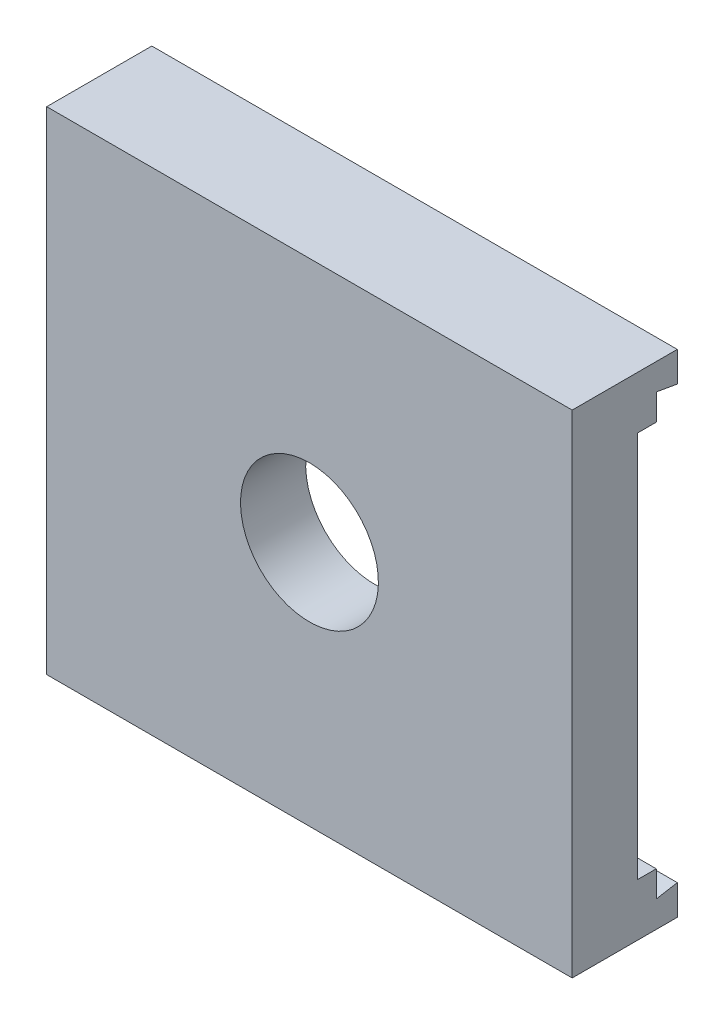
ISO-10303-21;
HEADER;
FILE_DESCRIPTION(('STEP AP214'),'2;1');
FILE_NAME('part.step','',(''),(''),'','','');
FILE_SCHEMA(('AUTOMOTIVE_DESIGN { 1 0 10303 214 1 1 1 1 }'));
ENDSEC;
DATA;
#1=APPLICATION_CONTEXT('core data for automotive mechanical design processes');
#2=APPLICATION_PROTOCOL_DEFINITION('international standard','automotive_design',2000,#1);
#3=PRODUCT_CONTEXT('',#1,'mechanical');
#4=PRODUCT('Part','Part','',(#3));
#5=PRODUCT_RELATED_PRODUCT_CATEGORY('part','',(#4));
#6=PRODUCT_DEFINITION_FORMATION('','',#4);
#7=PRODUCT_DEFINITION_CONTEXT('part definition',#1,'design');
#8=PRODUCT_DEFINITION('design','',#6,#7);
#9=PRODUCT_DEFINITION_SHAPE('','',#8);
#10=(LENGTH_UNIT() NAMED_UNIT(*) SI_UNIT(.MILLI.,.METRE.));
#11=(NAMED_UNIT(*) PLANE_ANGLE_UNIT() SI_UNIT($,.RADIAN.));
#12=(NAMED_UNIT(*) SI_UNIT($,.STERADIAN.) SOLID_ANGLE_UNIT());
#13=UNCERTAINTY_MEASURE_WITH_UNIT(LENGTH_MEASURE(1.E-05),#10,'distance_accuracy_value','');
#14=(GEOMETRIC_REPRESENTATION_CONTEXT(3) GLOBAL_UNCERTAINTY_ASSIGNED_CONTEXT((#13)) GLOBAL_UNIT_ASSIGNED_CONTEXT((#10,
#11,#12)) REPRESENTATION_CONTEXT('',''));
#15=CARTESIAN_POINT('',(0.,0.,0.));
#16=DIRECTION('',(0.,0.,1.));
#17=DIRECTION('',(1.,0.,0.));
#18=AXIS2_PLACEMENT_3D('',#15,#16,#17);
#19=CARTESIAN_POINT('',(-31.75,-29.718,7.874));
#20=DIRECTION('',(0.,1.,0.));
#21=DIRECTION('',(-1.,0.,0.));
#22=AXIS2_PLACEMENT_3D('',#19,#20,#21);
#23=PLANE('',#22);
#24=DIRECTION('',(0.,0.,1.));
#25=VECTOR('',#24,1.);
#26=CARTESIAN_POINT('',(31.75,-29.718,7.874));
#27=LINE('',#26,#25);
#28=CARTESIAN_POINT('',(31.75,-29.718,-4.826));
#29=VERTEX_POINT('',#28);
#30=CARTESIAN_POINT('',(31.75,-29.718,7.874));
#31=VERTEX_POINT('',#30);
#32=EDGE_CURVE('E107',#29,#31,#27,.T.);
#33=ORIENTED_EDGE('',*,*,#32,.T.);
#34=DIRECTION('',(1.,0.,0.));
#35=VECTOR('',#34,1.);
#36=CARTESIAN_POINT('',(-31.75,-29.718,7.874));
#37=LINE('',#36,#35);
#38=CARTESIAN_POINT('',(-31.75,-29.718,7.874));
#39=VERTEX_POINT('',#38);
#40=EDGE_CURVE('E9',#39,#31,#37,.T.);
#41=ORIENTED_EDGE('',*,*,#40,.F.);
#42=DIRECTION('',(0.,0.,1.));
#43=VECTOR('',#42,1.);
#44=CARTESIAN_POINT('',(-31.75,-29.718,7.874));
#45=LINE('',#44,#43);
#46=CARTESIAN_POINT('',(-31.75,-29.718,-4.826));
#47=VERTEX_POINT('',#46);
#48=EDGE_CURVE('E146',#47,#39,#45,.T.);
#49=ORIENTED_EDGE('',*,*,#48,.F.);
#50=DIRECTION('',(1.,0.,0.));
#51=VECTOR('',#50,1.);
#52=CARTESIAN_POINT('',(-31.75,-29.718,-4.826));
#53=LINE('',#52,#51);
#54=EDGE_CURVE('E120',#47,#29,#53,.T.);
#55=ORIENTED_EDGE('',*,*,#54,.T.);
#56=EDGE_LOOP('',(#33,#41,#49,#55));
#57=FACE_BOUND('',#56,.T.);
#58=ADVANCED_FACE('F14',(#57),#23,.F.);
#59=CARTESIAN_POINT('',(-31.75,29.718,7.874));
#60=DIRECTION('',(0.,0.,-1.));
#61=DIRECTION('',(0.,-1.,0.));
#62=AXIS2_PLACEMENT_3D('',#59,#60,#61);
#63=PLANE('',#62);
#64=CARTESIAN_POINT('',(0.,0.,7.874));
#65=DIRECTION('',(0.,0.,1.));
#66=DIRECTION('',(0.,1.,0.));
#67=AXIS2_PLACEMENT_3D('',#64,#65,#66);
#68=CIRCLE('',#67,8.3312);
#69=CARTESIAN_POINT('',(0.,8.3312,7.874));
#70=VERTEX_POINT('',#69);
#71=EDGE_CURVE('E123',#70,#70,#68,.T.);
#72=ORIENTED_EDGE('',*,*,#71,.F.);
#73=EDGE_LOOP('',(#72));
#74=FACE_BOUND('',#73,.T.);
#75=DIRECTION('',(0.,1.,0.));
#76=VECTOR('',#75,1.);
#77=CARTESIAN_POINT('',(31.75,29.718,7.874));
#78=LINE('',#77,#76);
#79=CARTESIAN_POINT('',(31.75,29.718,7.874));
#80=VERTEX_POINT('',#79);
#81=EDGE_CURVE('E103',#31,#80,#78,.T.);
#82=ORIENTED_EDGE('',*,*,#81,.T.);
#83=DIRECTION('',(1.,0.,0.));
#84=VECTOR('',#83,1.);
#85=CARTESIAN_POINT('',(-31.75,29.718,7.874));
#86=LINE('',#85,#84);
#87=CARTESIAN_POINT('',(-31.75,29.718,7.874));
#88=VERTEX_POINT('',#87);
#89=EDGE_CURVE('E22',#88,#80,#86,.T.);
#90=ORIENTED_EDGE('',*,*,#89,.F.);
#91=DIRECTION('',(0.,1.,0.));
#92=VECTOR('',#91,1.);
#93=CARTESIAN_POINT('',(-31.75,29.718,7.874));
#94=LINE('',#93,#92);
#95=EDGE_CURVE('E116',#39,#88,#94,.T.);
#96=ORIENTED_EDGE('',*,*,#95,.F.);
#97=ORIENTED_EDGE('',*,*,#40,.T.);
#98=EDGE_LOOP('',(#82,#90,#96,#97));
#99=FACE_BOUND('',#98,.T.);
#100=ADVANCED_FACE('F115',(#74,#99),#63,.F.);
#101=CARTESIAN_POINT('',(-31.75,29.718,7.874));
#102=DIRECTION('',(0.,-1.,0.));
#103=DIRECTION('',(1.,0.,0.));
#104=AXIS2_PLACEMENT_3D('',#101,#102,#103);
#105=PLANE('',#104);
#106=DIRECTION('',(0.,0.,-1.));
#107=VECTOR('',#106,1.);
#108=CARTESIAN_POINT('',(31.75,29.718,7.874));
#109=LINE('',#108,#107);
#110=CARTESIAN_POINT('',(31.75,29.718,-4.826));
#111=VERTEX_POINT('',#110);
#112=EDGE_CURVE('E109',#80,#111,#109,.T.);
#113=ORIENTED_EDGE('',*,*,#112,.T.);
#114=DIRECTION('',(1.,0.,0.));
#115=VECTOR('',#114,1.);
#116=CARTESIAN_POINT('',(-31.75,29.718,-4.826));
#117=LINE('',#116,#115);
#118=CARTESIAN_POINT('',(-31.75,29.718,-4.826));
#119=VERTEX_POINT('',#118);
#120=EDGE_CURVE('E192',#119,#111,#117,.T.);
#121=ORIENTED_EDGE('',*,*,#120,.F.);
#122=DIRECTION('',(0.,0.,-1.));
#123=VECTOR('',#122,1.);
#124=CARTESIAN_POINT('',(-31.75,29.718,7.874));
#125=LINE('',#124,#123);
#126=EDGE_CURVE('E149',#88,#119,#125,.T.);
#127=ORIENTED_EDGE('',*,*,#126,.F.);
#128=ORIENTED_EDGE('',*,*,#89,.T.);
#129=EDGE_LOOP('',(#113,#121,#127,#128));
#130=FACE_BOUND('',#129,.T.);
#131=ADVANCED_FACE('F197',(#130),#105,.F.);
#132=CARTESIAN_POINT('',(-31.75,29.718,-4.826));
#133=DIRECTION('',(0.,0.,1.));
#134=DIRECTION('',(0.,1.,0.));
#135=AXIS2_PLACEMENT_3D('',#132,#133,#134);
#136=PLANE('',#135);
#137=DIRECTION('',(0.,-1.,0.));
#138=VECTOR('',#137,1.);
#139=CARTESIAN_POINT('',(31.75,29.718,-4.826));
#140=LINE('',#139,#138);
#141=CARTESIAN_POINT('',(31.75,26.0858,-4.826));
#142=VERTEX_POINT('',#141);
#143=EDGE_CURVE('E127',#111,#142,#140,.T.);
#144=ORIENTED_EDGE('',*,*,#143,.T.);
#145=DIRECTION('',(1.,0.,0.));
#146=VECTOR('',#145,1.);
#147=CARTESIAN_POINT('',(-31.75,26.0858,-4.826));
#148=LINE('',#147,#146);
#149=CARTESIAN_POINT('',(-31.75,26.0858,-4.826));
#150=VERTEX_POINT('',#149);
#151=EDGE_CURVE('E189',#150,#142,#148,.T.);
#152=ORIENTED_EDGE('',*,*,#151,.F.);
#153=DIRECTION('',(0.,-1.,0.));
#154=VECTOR('',#153,1.);
#155=CARTESIAN_POINT('',(-31.75,29.718,-4.826));
#156=LINE('',#155,#154);
#157=EDGE_CURVE('E151',#119,#150,#156,.T.);
#158=ORIENTED_EDGE('',*,*,#157,.F.);
#159=ORIENTED_EDGE('',*,*,#120,.T.);
#160=EDGE_LOOP('',(#144,#152,#158,#159));
#161=FACE_BOUND('',#160,.T.);
#162=ADVANCED_FACE('F205',(#161),#136,.F.);
#163=CARTESIAN_POINT('',(-31.75,26.0858,-4.826));
#164=DIRECTION('',(0.,0.984807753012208,-0.173648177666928));
#165=DIRECTION('',(0.,-0.173648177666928,-0.984807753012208));
#166=AXIS2_PLACEMENT_3D('',#163,#164,#165);
#167=PLANE('',#166);
#168=DIRECTION('',(0.,0.173648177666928,0.984807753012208));
#169=VECTOR('',#168,1.);
#170=CARTESIAN_POINT('',(31.75,26.0858,-4.826));
#171=LINE('',#170,#169);
#172=CARTESIAN_POINT('',(31.75,26.5336705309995,-2.286));
#173=VERTEX_POINT('',#172);
#174=EDGE_CURVE('E129',#142,#173,#171,.T.);
#175=ORIENTED_EDGE('',*,*,#174,.T.);
#176=DIRECTION('',(1.,0.,0.));
#177=VECTOR('',#176,1.);
#178=CARTESIAN_POINT('',(-31.75,26.5336705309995,-2.286));
#179=LINE('',#178,#177);
#180=CARTESIAN_POINT('',(-31.75,26.5336705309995,-2.286));
#181=VERTEX_POINT('',#180);
#182=EDGE_CURVE('E186',#181,#173,#179,.T.);
#183=ORIENTED_EDGE('',*,*,#182,.F.);
#184=DIRECTION('',(0.,0.173648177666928,0.984807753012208));
#185=VECTOR('',#184,1.);
#186=CARTESIAN_POINT('',(-31.75,26.0858,-4.826));
#187=LINE('',#186,#185);
#188=EDGE_CURVE('E153',#150,#181,#187,.T.);
#189=ORIENTED_EDGE('',*,*,#188,.F.);
#190=ORIENTED_EDGE('',*,*,#151,.T.);
#191=EDGE_LOOP('',(#175,#183,#189,#190));
#192=FACE_BOUND('',#191,.T.);
#193=ADVANCED_FACE('F208',(#192),#167,.F.);
#194=CARTESIAN_POINT('',(-31.75,26.5336705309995,-2.286));
#195=DIRECTION('',(0.,0.,1.));
#196=DIRECTION('',(0.,1.,0.));
#197=AXIS2_PLACEMENT_3D('',#194,#195,#196);
#198=PLANE('',#197);
#199=DIRECTION('',(0.,-1.,0.));
#200=VECTOR('',#199,1.);
#201=CARTESIAN_POINT('',(31.75,26.5336705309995,-2.286));
#202=LINE('',#201,#200);
#203=CARTESIAN_POINT('',(31.75,23.368,-2.286));
#204=VERTEX_POINT('',#203);
#205=EDGE_CURVE('E131',#173,#204,#202,.T.);
#206=ORIENTED_EDGE('',*,*,#205,.T.);
#207=DIRECTION('',(1.,0.,0.));
#208=VECTOR('',#207,1.);
#209=CARTESIAN_POINT('',(-31.75,23.368,-2.286));
#210=LINE('',#209,#208);
#211=CARTESIAN_POINT('',(-31.75,23.368,-2.286));
#212=VERTEX_POINT('',#211);
#213=EDGE_CURVE('E183',#212,#204,#210,.T.);
#214=ORIENTED_EDGE('',*,*,#213,.F.);
#215=DIRECTION('',(0.,-1.,0.));
#216=VECTOR('',#215,1.);
#217=CARTESIAN_POINT('',(-31.75,26.5336705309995,-2.286));
#218=LINE('',#217,#216);
#219=EDGE_CURVE('E155',#181,#212,#218,.T.);
#220=ORIENTED_EDGE('',*,*,#219,.F.);
#221=ORIENTED_EDGE('',*,*,#182,.T.);
#222=EDGE_LOOP('',(#206,#214,#220,#221));
#223=FACE_BOUND('',#222,.T.);
#224=ADVANCED_FACE('F213',(#223),#198,.F.);
#225=CARTESIAN_POINT('',(-31.75,23.368,-2.286));
#226=DIRECTION('',(0.,1.,0.));
#227=DIRECTION('',(-1.,0.,0.));
#228=AXIS2_PLACEMENT_3D('',#225,#226,#227);
#229=PLANE('',#228);
#230=DIRECTION('',(0.,0.,1.));
#231=VECTOR('',#230,1.);
#232=CARTESIAN_POINT('',(31.75,23.368,-2.286));
#233=LINE('',#232,#231);
#234=CARTESIAN_POINT('',(31.75,23.368,0.));
#235=VERTEX_POINT('',#234);
#236=EDGE_CURVE('E133',#204,#235,#233,.T.);
#237=ORIENTED_EDGE('',*,*,#236,.T.);
#238=DIRECTION('',(1.,0.,0.));
#239=VECTOR('',#238,1.);
#240=CARTESIAN_POINT('',(-31.75,23.368,0.));
#241=LINE('',#240,#239);
#242=CARTESIAN_POINT('',(-31.75,23.368,0.));
#243=VERTEX_POINT('',#242);
#244=EDGE_CURVE('E180',#243,#235,#241,.T.);
#245=ORIENTED_EDGE('',*,*,#244,.F.);
#246=DIRECTION('',(0.,0.,1.));
#247=VECTOR('',#246,1.);
#248=CARTESIAN_POINT('',(-31.75,23.368,-2.286));
#249=LINE('',#248,#247);
#250=EDGE_CURVE('E157',#212,#243,#249,.T.);
#251=ORIENTED_EDGE('',*,*,#250,.F.);
#252=ORIENTED_EDGE('',*,*,#213,.T.);
#253=EDGE_LOOP('',(#237,#245,#251,#252));
#254=FACE_BOUND('',#253,.T.);
#255=ADVANCED_FACE('F219',(#254),#229,.F.);
#256=CARTESIAN_POINT('',(-31.75,-23.368,0.));
#257=DIRECTION('',(0.,0.,1.));
#258=DIRECTION('',(0.,1.,0.));
#259=AXIS2_PLACEMENT_3D('',#256,#257,#258);
#260=PLANE('',#259);
#261=CARTESIAN_POINT('',(0.,0.,0.));
#262=DIRECTION('',(0.,0.,1.));
#263=DIRECTION('',(0.,1.,0.));
#264=AXIS2_PLACEMENT_3D('',#261,#262,#263);
#265=CIRCLE('',#264,8.3312);
#266=CARTESIAN_POINT('',(0.,8.3312,0.));
#267=VERTEX_POINT('',#266);
#268=EDGE_CURVE('E17',#267,#267,#265,.T.);
#269=ORIENTED_EDGE('',*,*,#268,.T.);
#270=EDGE_LOOP('',(#269));
#271=FACE_BOUND('',#270,.T.);
#272=DIRECTION('',(0.,-1.,0.));
#273=VECTOR('',#272,1.);
#274=CARTESIAN_POINT('',(31.75,-23.368,0.));
#275=LINE('',#274,#273);
#276=CARTESIAN_POINT('',(31.75,-23.368,0.));
#277=VERTEX_POINT('',#276);
#278=EDGE_CURVE('E136',#235,#277,#275,.T.);
#279=ORIENTED_EDGE('',*,*,#278,.T.);
#280=DIRECTION('',(1.,0.,0.));
#281=VECTOR('',#280,1.);
#282=CARTESIAN_POINT('',(-31.75,-23.368,0.));
#283=LINE('',#282,#281);
#284=CARTESIAN_POINT('',(-31.75,-23.368,0.));
#285=VERTEX_POINT('',#284);
#286=EDGE_CURVE('E177',#285,#277,#283,.T.);
#287=ORIENTED_EDGE('',*,*,#286,.F.);
#288=DIRECTION('',(0.,-1.,0.));
#289=VECTOR('',#288,1.);
#290=CARTESIAN_POINT('',(-31.75,23.368,0.));
#291=LINE('',#290,#289);
#292=EDGE_CURVE('E159',#243,#285,#291,.T.);
#293=ORIENTED_EDGE('',*,*,#292,.F.);
#294=ORIENTED_EDGE('',*,*,#244,.T.);
#295=EDGE_LOOP('',(#279,#287,#293,#294));
#296=FACE_BOUND('',#295,.T.);
#297=ADVANCED_FACE('F222',(#271,#296),#260,.F.);
#298=CARTESIAN_POINT('',(-31.75,-23.368,-2.286));
#299=DIRECTION('',(0.,-1.,0.));
#300=DIRECTION('',(1.,0.,0.));
#301=AXIS2_PLACEMENT_3D('',#298,#299,#300);
#302=PLANE('',#301);
#303=DIRECTION('',(0.,0.,-1.));
#304=VECTOR('',#303,1.);
#305=CARTESIAN_POINT('',(31.75,-23.368,-2.286));
#306=LINE('',#305,#304);
#307=CARTESIAN_POINT('',(31.75,-23.368,-2.286));
#308=VERTEX_POINT('',#307);
#309=EDGE_CURVE('E138',#277,#308,#306,.T.);
#310=ORIENTED_EDGE('',*,*,#309,.T.);
#311=DIRECTION('',(1.,0.,0.));
#312=VECTOR('',#311,1.);
#313=CARTESIAN_POINT('',(-31.75,-23.368,-2.286));
#314=LINE('',#313,#312);
#315=CARTESIAN_POINT('',(-31.75,-23.368,-2.286));
#316=VERTEX_POINT('',#315);
#317=EDGE_CURVE('E174',#316,#308,#314,.T.);
#318=ORIENTED_EDGE('',*,*,#317,.F.);
#319=DIRECTION('',(0.,0.,-1.));
#320=VECTOR('',#319,1.);
#321=CARTESIAN_POINT('',(-31.75,-23.368,-2.286));
#322=LINE('',#321,#320);
#323=EDGE_CURVE('E161',#285,#316,#322,.T.);
#324=ORIENTED_EDGE('',*,*,#323,.F.);
#325=ORIENTED_EDGE('',*,*,#286,.T.);
#326=EDGE_LOOP('',(#310,#318,#324,#325));
#327=FACE_BOUND('',#326,.T.);
#328=ADVANCED_FACE('F227',(#327),#302,.F.);
#329=CARTESIAN_POINT('',(-31.75,-26.5336705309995,-2.286));
#330=DIRECTION('',(0.,0.,1.));
#331=DIRECTION('',(-1.,0.,0.));
#332=AXIS2_PLACEMENT_3D('',#329,#330,#331);
#333=PLANE('',#332);
#334=DIRECTION('',(0.,-1.,0.));
#335=VECTOR('',#334,1.);
#336=CARTESIAN_POINT('',(31.75,-26.5336705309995,-2.286));
#337=LINE('',#336,#335);
#338=CARTESIAN_POINT('',(31.75,-26.5336705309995,-2.286));
#339=VERTEX_POINT('',#338);
#340=EDGE_CURVE('E140',#308,#339,#337,.T.);
#341=ORIENTED_EDGE('',*,*,#340,.T.);
#342=DIRECTION('',(1.,0.,0.));
#343=VECTOR('',#342,1.);
#344=CARTESIAN_POINT('',(-31.75,-26.5336705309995,-2.286));
#345=LINE('',#344,#343);
#346=CARTESIAN_POINT('',(-31.75,-26.5336705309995,-2.286));
#347=VERTEX_POINT('',#346);
#348=EDGE_CURVE('E171',#347,#339,#345,.T.);
#349=ORIENTED_EDGE('',*,*,#348,.F.);
#350=DIRECTION('',(0.,-1.,0.));
#351=VECTOR('',#350,1.);
#352=CARTESIAN_POINT('',(-31.75,-26.5336705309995,-2.286));
#353=LINE('',#352,#351);
#354=EDGE_CURVE('E163',#316,#347,#353,.T.);
#355=ORIENTED_EDGE('',*,*,#354,.F.);
#356=ORIENTED_EDGE('',*,*,#317,.T.);
#357=EDGE_LOOP('',(#341,#349,#355,#356));
#358=FACE_BOUND('',#357,.T.);
#359=ADVANCED_FACE('F231',(#358),#333,.F.);
#360=CARTESIAN_POINT('',(-31.75,-26.0858,-4.826));
#361=DIRECTION('',(0.,-0.984807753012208,-0.173648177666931));
#362=DIRECTION('',(0.,-0.173648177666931,0.984807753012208));
#363=AXIS2_PLACEMENT_3D('',#360,#361,#362);
#364=PLANE('',#363);
#365=DIRECTION('',(0.,0.173648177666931,-0.984807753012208));
#366=VECTOR('',#365,1.);
#367=CARTESIAN_POINT('',(31.75,-26.0858,-4.826));
#368=LINE('',#367,#366);
#369=CARTESIAN_POINT('',(31.75,-26.0858,-4.826));
#370=VERTEX_POINT('',#369);
#371=EDGE_CURVE('E142',#339,#370,#368,.T.);
#372=ORIENTED_EDGE('',*,*,#371,.T.);
#373=DIRECTION('',(1.,0.,0.));
#374=VECTOR('',#373,1.);
#375=CARTESIAN_POINT('',(-31.75,-26.0858,-4.826));
#376=LINE('',#375,#374);
#377=CARTESIAN_POINT('',(-31.75,-26.0858,-4.826));
#378=VERTEX_POINT('',#377);
#379=EDGE_CURVE('E168',#378,#370,#376,.T.);
#380=ORIENTED_EDGE('',*,*,#379,.F.);
#381=DIRECTION('',(0.,0.173648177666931,-0.984807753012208));
#382=VECTOR('',#381,1.);
#383=CARTESIAN_POINT('',(-31.75,-26.0858,-4.826));
#384=LINE('',#383,#382);
#385=EDGE_CURVE('E34',#347,#378,#384,.T.);
#386=ORIENTED_EDGE('',*,*,#385,.F.);
#387=ORIENTED_EDGE('',*,*,#348,.T.);
#388=EDGE_LOOP('',(#372,#380,#386,#387));
#389=FACE_BOUND('',#388,.T.);
#390=ADVANCED_FACE('F235',(#389),#364,.F.);
#391=CARTESIAN_POINT('',(-31.75,-29.718,-4.826));
#392=DIRECTION('',(0.,0.,1.));
#393=DIRECTION('',(0.,1.,0.));
#394=AXIS2_PLACEMENT_3D('',#391,#392,#393);
#395=PLANE('',#394);
#396=DIRECTION('',(0.,-1.,0.));
#397=VECTOR('',#396,1.);
#398=CARTESIAN_POINT('',(31.75,-29.718,-4.826));
#399=LINE('',#398,#397);
#400=EDGE_CURVE('E144',#370,#29,#399,.T.);
#401=ORIENTED_EDGE('',*,*,#400,.T.);
#402=ORIENTED_EDGE('',*,*,#54,.F.);
#403=DIRECTION('',(0.,-1.,0.));
#404=VECTOR('',#403,1.);
#405=CARTESIAN_POINT('',(-31.75,-29.718,-4.826));
#406=LINE('',#405,#404);
#407=EDGE_CURVE('E29',#378,#47,#406,.T.);
#408=ORIENTED_EDGE('',*,*,#407,.F.);
#409=ORIENTED_EDGE('',*,*,#379,.T.);
#410=EDGE_LOOP('',(#401,#402,#408,#409));
#411=FACE_BOUND('',#410,.T.);
#412=ADVANCED_FACE('F237',(#411),#395,.F.);
#413=CARTESIAN_POINT('',(-31.75,-29.718,-2.286));
#414=DIRECTION('',(1.,0.,0.));
#415=DIRECTION('',(0.,1.,0.));
#416=AXIS2_PLACEMENT_3D('',#413,#414,#415);
#417=PLANE('',#416);
#418=ORIENTED_EDGE('',*,*,#48,.T.);
#419=ORIENTED_EDGE('',*,*,#95,.T.);
#420=ORIENTED_EDGE('',*,*,#126,.T.);
#421=ORIENTED_EDGE('',*,*,#157,.T.);
#422=ORIENTED_EDGE('',*,*,#188,.T.);
#423=ORIENTED_EDGE('',*,*,#219,.T.);
#424=ORIENTED_EDGE('',*,*,#250,.T.);
#425=ORIENTED_EDGE('',*,*,#292,.T.);
#426=ORIENTED_EDGE('',*,*,#323,.T.);
#427=ORIENTED_EDGE('',*,*,#354,.T.);
#428=ORIENTED_EDGE('',*,*,#385,.T.);
#429=ORIENTED_EDGE('',*,*,#407,.T.);
#430=EDGE_LOOP('',(#418,#419,#420,#421,#422,#423,#424,#425,#426,#427,#428,#429));
#431=FACE_BOUND('',#430,.T.);
#432=ADVANCED_FACE('F200',(#431),#417,.F.);
#433=CARTESIAN_POINT('',(31.75,-29.718,-2.286));
#434=DIRECTION('',(1.,0.,0.));
#435=DIRECTION('',(0.,1.,0.));
#436=AXIS2_PLACEMENT_3D('',#433,#434,#435);
#437=PLANE('',#436);
#438=ORIENTED_EDGE('',*,*,#32,.F.);
#439=ORIENTED_EDGE('',*,*,#400,.F.);
#440=ORIENTED_EDGE('',*,*,#371,.F.);
#441=ORIENTED_EDGE('',*,*,#340,.F.);
#442=ORIENTED_EDGE('',*,*,#309,.F.);
#443=ORIENTED_EDGE('',*,*,#278,.F.);
#444=ORIENTED_EDGE('',*,*,#236,.F.);
#445=ORIENTED_EDGE('',*,*,#205,.F.);
#446=ORIENTED_EDGE('',*,*,#174,.F.);
#447=ORIENTED_EDGE('',*,*,#143,.F.);
#448=ORIENTED_EDGE('',*,*,#112,.F.);
#449=ORIENTED_EDGE('',*,*,#81,.F.);
#450=EDGE_LOOP('',(#438,#439,#440,#441,#442,#443,#444,#445,#446,#447,#448,#449));
#451=FACE_BOUND('',#450,.T.);
#452=ADVANCED_FACE('F104',(#451),#437,.T.);
#453=CARTESIAN_POINT('',(0.,0.,-4.826));
#454=DIRECTION('',(0.,0.,1.));
#455=DIRECTION('',(0.,1.,0.));
#456=AXIS2_PLACEMENT_3D('',#453,#454,#455);
#457=CYLINDRICAL_SURFACE('',#456,8.3312);
#458=ORIENTED_EDGE('',*,*,#71,.T.);
#459=EDGE_LOOP('',(#458));
#460=FACE_BOUND('',#459,.T.);
#461=ORIENTED_EDGE('',*,*,#268,.F.);
#462=EDGE_LOOP('',(#461));
#463=FACE_BOUND('',#462,.T.);
#464=ADVANCED_FACE('F357',(#460,#463),#457,.F.);
#465=CLOSED_SHELL('',(#58,#100,#131,#162,#193,#224,#255,#297,#328,#359,#390,#412,#432,#452,#464));
#466=MANIFOLD_SOLID_BREP('B1',#465);
#467=ADVANCED_BREP_SHAPE_REPRESENTATION('',(#18,#466),#14);
#468=SHAPE_DEFINITION_REPRESENTATION(#9,#467);
ENDSEC;
END-ISO-10303-21;
